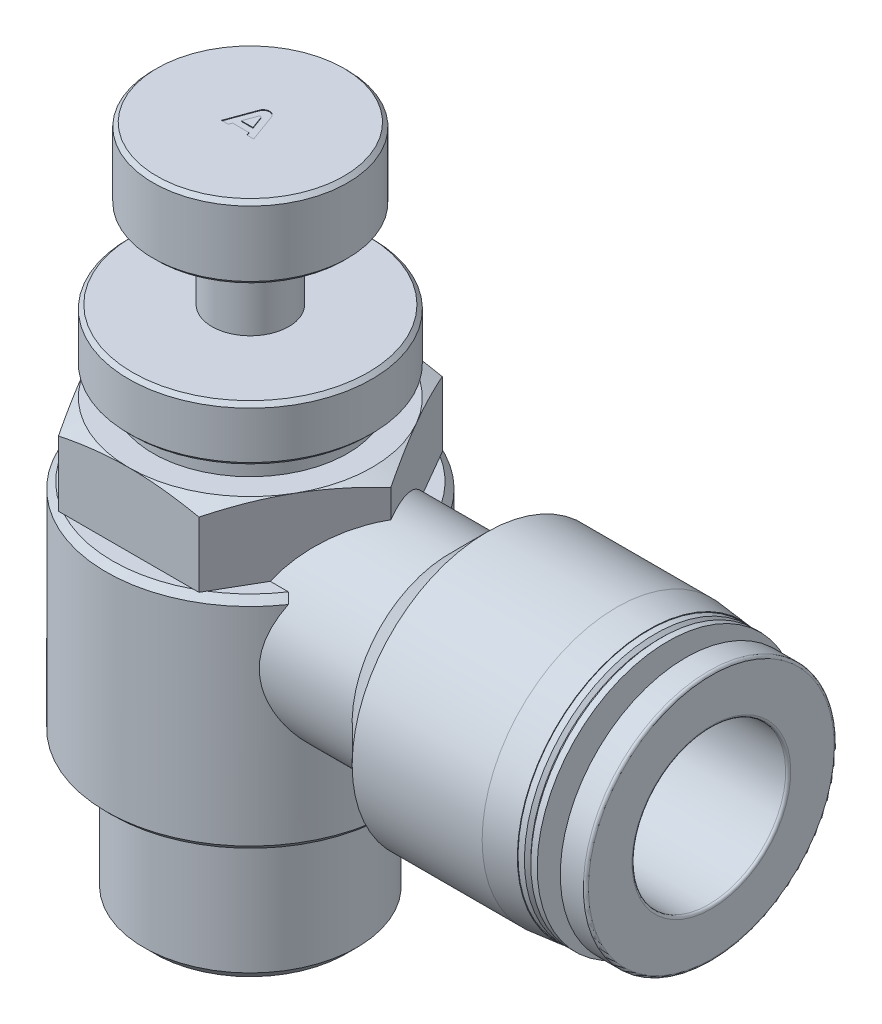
from build123d import *

# Parameters (mm, degrees)
SKETCH_2_R          = 19
CUT_EXTRUDE_1_DEPTH = 5.7
CUT_EXTRUDE_2_DEPTH = 0.05


with BuildPart() as part:
    # Sketch 1 → Revolve 1 (revolve)
    with BuildSketch(Plane.XY, mode=Mode.PRIVATE) as revolve_1_sk:
        Polygon((0, -23.5), (-7.475, -23.5), (-8.331, -22.644), (-8.331, -12.5), (-10.75, -12.5), (-11.25, -12), (-11.25, 4.2), (-10.75, 4.7), (-10.969655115, 4.7), (-10.969655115, 9.79124892), (-9.5, 10.4), (-7.6, 10.4), (-7.6, 11.6), (-7.3, 11.9), (-3, 11.9), (-3, 12.4), (-9.2, 12.4), (-9.5, 12.7), (-9.5, 16.375), (-9.2, 16.675), (-3, 16.675), (-3, 22.9935), (-2.6935, 23.3), (-7.3, 23.3), (-7.6, 23.6), (-7.6, 28.7), (-7.3, 29), (0, 29), align=None)
    revolve(revolve_1_sk.sketch.rotate(Axis((0, 29, 0), (0, -1, 0)), 90), axis=Axis((0, 29, 0), (0, -1, 0)))

    # Sketch 2 → Cut-Extrude 1 (cut)
    with BuildSketch(Plane(origin=(0, 4.7, 0), x_dir=(1, 0, 0), z_dir=(0, 1, 0))):
        Circle(SKETCH_2_R)
        Polygon((-10.969655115, 0), (-5.484827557, -9.5), (5.484827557, -9.5), (10.969655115, 0), (5.484827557, 9.5), (-5.484827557, 9.5), align=None, mode=Mode.SUBTRACT)
    extrude(amount=CUT_EXTRUDE_1_DEPTH, mode=Mode.SUBTRACT)

    # Sketch 3 → Revolve 2 (revolve)
    with BuildSketch(Plane.XY, mode=Mode.PRIVATE) as revolve_2_sk:
        with BuildLine():
            Line((0, 7.6), (0, 4))
            Line((0, 4), (13, 4))
            Line((13, 4), (13, 6))
            Line((13, 6), (35.8, 6))
            ThreePointArc((35.8, 6), (35.941421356, 6.058578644), (36, 6.2))
            Line((36, 6.2), (36, 9.6))
            ThreePointArc((36, 9.6), (35.941421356, 9.741421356), (35.8, 9.8))
            Line((35.8, 9.8), (34, 9.8))
            Line((34, 9.8), (34, 6.9))
            Line((34, 6.9), (32.6, 6.9))
            Line((32.6, 6.9), (32.6, 10.2))
            Line((32.6, 10.2), (32.1, 10.2))
            Line((32.1, 10.2), (31.85, 9.95))
            Line((31.85, 9.95), (31.6, 10.2))
            Line((31.6, 10.2), (31.1, 10.2))
            Line((31.1, 10.2), (31.1, 10.25))
            Line((31.1, 10.25), (28.6, 10.5))
            Line((28.6, 10.5), (18.449655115, 10.5))
            Line((18.449655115, 10.5), (15.549655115, 7.6))
            Line((15.549655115, 7.6), (0, 7.6))
        make_face()
    revolve(revolve_2_sk.sketch.rotate(Axis((36, 0, 0), (-1, 0, 0)), 180), axis=Axis((36, 0, 0), (-1, 0, 0)))

    # Sketch 4 → Cut-Revolve 1 (revolve, cut)
    with BuildSketch(Plane.XY, mode=Mode.PRIVATE) as cut_revolve_1_sk:
        with BuildLine():
            Line((0, -23.5), (-4.4655, -23.5))
            ThreePointArc((-4.4655, -23.5), (-4.253367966, -23.412132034), (-4.1655, -23.2))
            Line((-4.1655, -23.2), (-4.1655, 0))
            Line((-4.1655, 0), (-2.777, 0))
            Line((-2.777, 0), (-2.777, 2.777))
            ThreePointArc((-2.777, 2.777), (-1.963635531, 4.740635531), (0, 5.554))
            Line((0, 5.554), (0, -23.5))
        make_face()
    revolve(cut_revolve_1_sk.sketch.rotate(Axis((0, 5.554, 0), (0, -1, 0)), 90), axis=Axis((0, 5.554, 0), (0, -1, 0)), mode=Mode.SUBTRACT)

    # Sketch 5 → Cut-Revolve 2 (revolve, cut)
    with BuildSketch(Plane.XY, mode=Mode.PRIVATE) as cut_revolve_2_sk:
        Polygon((0, 0), (0, 4), (13, 4), (13, 6), (36, 6), (36, 0), align=None)
    revolve(cut_revolve_2_sk.sketch.rotate(Axis((36, 0, 0), (-1, 0, 0)), 180), axis=Axis((36, 0, 0), (-1, 0, 0)), mode=Mode.SUBTRACT)

    # Sketch 6 → Cut-Extrude 2 (cut)
    with BuildSketch(Plane(origin=(0, 29, 0), x_dir=(1, 0, 0), z_dir=(0, 1, 0))):
        with BuildLine():
            Line((-1.260029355, -1), (-0.727940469, -1))
            Line((-0.727940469, -1), (-0.63694791, -0.75))
            Line((-0.63694791, -0.75), (0.63694791, -0.75))
            Line((0.63694791, -0.75), (0.727940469, -1))
            Line((0.727940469, -1), (1.260029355, -1))
            Line((1.260029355, -1), (0.46984631, 1.171010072))
            ThreePointArc((0.46984631, 1.171010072), (0, 1.5), (-0.46984631, 1.171010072))
            Line((-0.46984631, 1.171010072), (-1.260029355, -1))
        make_face()
        with BuildLine():
            Line((-0.454962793, -0.25), (0.454962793, -0.25))
            Line((0.454962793, -0.25), (0.093969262, 0.741821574))
            ThreePointArc((0.093969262, 0.741821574), (0, 0.80761956), (-0.093969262, 0.741821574))
            Line((-0.093969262, 0.741821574), (-0.454962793, -0.25))
        make_face(mode=Mode.SUBTRACT)
    extrude(amount=-CUT_EXTRUDE_2_DEPTH, mode=Mode.SUBTRACT)


solid = part.part
